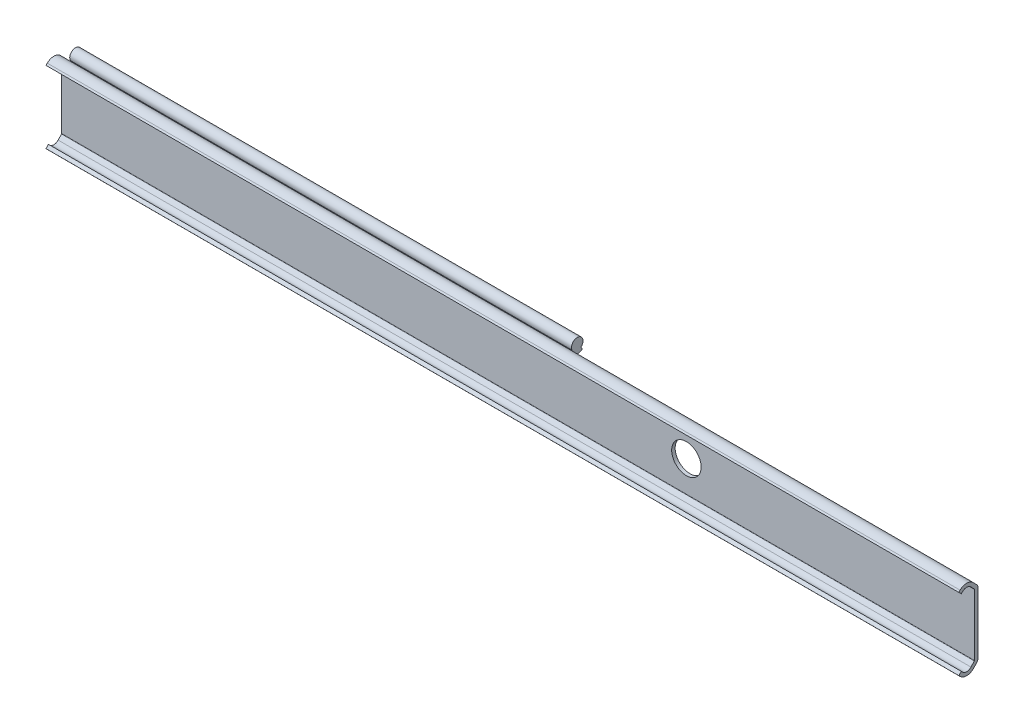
ISO-10303-21;
HEADER;
FILE_DESCRIPTION(('STEP AP214'),'2;1');
FILE_NAME('part.step','',(''),(''),'','','');
FILE_SCHEMA(('AUTOMOTIVE_DESIGN { 1 0 10303 214 1 1 1 1 }'));
ENDSEC;
DATA;
#1=APPLICATION_CONTEXT('core data for automotive mechanical design processes');
#2=APPLICATION_PROTOCOL_DEFINITION('international standard','automotive_design',2000,#1);
#3=PRODUCT_CONTEXT('',#1,'mechanical');
#4=PRODUCT('Part','Part','',(#3));
#5=PRODUCT_RELATED_PRODUCT_CATEGORY('part','',(#4));
#6=PRODUCT_DEFINITION_FORMATION('','',#4);
#7=PRODUCT_DEFINITION_CONTEXT('part definition',#1,'design');
#8=PRODUCT_DEFINITION('design','',#6,#7);
#9=PRODUCT_DEFINITION_SHAPE('','',#8);
#10=(LENGTH_UNIT() NAMED_UNIT(*) SI_UNIT(.MILLI.,.METRE.));
#11=(NAMED_UNIT(*) PLANE_ANGLE_UNIT() SI_UNIT($,.RADIAN.));
#12=(NAMED_UNIT(*) SI_UNIT($,.STERADIAN.) SOLID_ANGLE_UNIT());
#13=UNCERTAINTY_MEASURE_WITH_UNIT(LENGTH_MEASURE(1.E-05),#10,'distance_accuracy_value','');
#14=(GEOMETRIC_REPRESENTATION_CONTEXT(3) GLOBAL_UNCERTAINTY_ASSIGNED_CONTEXT((#13)) GLOBAL_UNIT_ASSIGNED_CONTEXT((#10,
#11,#12)) REPRESENTATION_CONTEXT('',''));
#15=CARTESIAN_POINT('',(0.,0.,0.));
#16=DIRECTION('',(0.,0.,1.));
#17=DIRECTION('',(1.,0.,0.));
#18=AXIS2_PLACEMENT_3D('',#15,#16,#17);
#19=CARTESIAN_POINT('',(-4.,-13.5610180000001,0.));
#20=DIRECTION('',(0.,0.,-1.));
#21=DIRECTION('',(1.,0.,0.));
#22=AXIS2_PLACEMENT_3D('',#19,#20,#21);
#23=PLANE('',#22);
#24=CARTESIAN_POINT('',(275.4,0.,0.));
#25=DIRECTION('',(0.,0.,1.));
#26=DIRECTION('',(0.,-1.,0.));
#27=AXIS2_PLACEMENT_3D('',#24,#25,#26);
#28=CIRCLE('',#27,6.5);
#29=CARTESIAN_POINT('',(275.4,-6.50000000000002,0.));
#30=VERTEX_POINT('',#29);
#31=EDGE_CURVE('E305',#30,#30,#28,.F.);
#32=ORIENTED_EDGE('',*,*,#31,.F.);
#33=EDGE_LOOP('',(#32));
#34=FACE_BOUND('',#33,.T.);
#35=DIRECTION('',(1.,0.,0.));
#36=VECTOR('',#35,1.);
#37=CARTESIAN_POINT('',(-4.,-13.5610180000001,0.));
#38=LINE('',#37,#36);
#39=CARTESIAN_POINT('',(0.,-13.5610180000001,0.));
#40=VERTEX_POINT('',#39);
#41=CARTESIAN_POINT('',(402.4,-13.561018,0.));
#42=VERTEX_POINT('',#41);
#43=EDGE_CURVE('E258',#40,#42,#38,.T.);
#44=ORIENTED_EDGE('',*,*,#43,.F.);
#45=DIRECTION('',(0.,-1.,0.));
#46=VECTOR('',#45,1.);
#47=CARTESIAN_POINT('',(0.,-10.7622239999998,0.));
#48=LINE('',#47,#46);
#49=CARTESIAN_POINT('',(0.,-10.7622239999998,0.));
#50=VERTEX_POINT('',#49);
#51=EDGE_CURVE('E478',#50,#40,#48,.T.);
#52=ORIENTED_EDGE('',*,*,#51,.F.);
#53=DIRECTION('',(1.,0.,0.));
#54=VECTOR('',#53,1.);
#55=CARTESIAN_POINT('',(0.,-10.7622239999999,0.));
#56=LINE('',#55,#54);
#57=CARTESIAN_POINT('',(221.2,-10.7622239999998,0.));
#58=VERTEX_POINT('',#57);
#59=EDGE_CURVE('E9',#50,#58,#56,.T.);
#60=ORIENTED_EDGE('',*,*,#59,.T.);
#61=DIRECTION('',(0.,1.,0.));
#62=VECTOR('',#61,1.);
#63=CARTESIAN_POINT('',(221.2,-30.,0.));
#64=LINE('',#63,#62);
#65=CARTESIAN_POINT('',(221.2,10.7622239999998,0.));
#66=VERTEX_POINT('',#65);
#67=EDGE_CURVE('E374',#58,#66,#64,.T.);
#68=ORIENTED_EDGE('',*,*,#67,.T.);
#69=DIRECTION('',(1.,0.,0.));
#70=VECTOR('',#69,1.);
#71=CARTESIAN_POINT('',(0.,10.7622239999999,0.));
#72=LINE('',#71,#70);
#73=CARTESIAN_POINT('',(0.,10.7622239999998,0.));
#74=VERTEX_POINT('',#73);
#75=EDGE_CURVE('E23',#74,#66,#72,.T.);
#76=ORIENTED_EDGE('',*,*,#75,.F.);
#77=DIRECTION('',(0.,-1.,0.));
#78=VECTOR('',#77,1.);
#79=CARTESIAN_POINT('',(0.,13.561018,0.));
#80=LINE('',#79,#78);
#81=CARTESIAN_POINT('',(0.,13.561018,0.));
#82=VERTEX_POINT('',#81);
#83=EDGE_CURVE('E238',#82,#74,#80,.T.);
#84=ORIENTED_EDGE('',*,*,#83,.F.);
#85=DIRECTION('',(1.,0.,0.));
#86=VECTOR('',#85,1.);
#87=CARTESIAN_POINT('',(-4.,13.561018,0.));
#88=LINE('',#87,#86);
#89=CARTESIAN_POINT('',(402.4,13.561018,0.));
#90=VERTEX_POINT('',#89);
#91=EDGE_CURVE('E249',#82,#90,#88,.T.);
#92=ORIENTED_EDGE('',*,*,#91,.T.);
#93=DIRECTION('',(0.,1.,0.));
#94=VECTOR('',#93,1.);
#95=CARTESIAN_POINT('',(402.4,-13.561018,0.));
#96=LINE('',#95,#94);
#97=EDGE_CURVE('E438',#42,#90,#96,.T.);
#98=ORIENTED_EDGE('',*,*,#97,.F.);
#99=EDGE_LOOP('',(#44,#52,#60,#68,#76,#84,#92,#98));
#100=FACE_BOUND('',#99,.T.);
#101=ADVANCED_FACE('F14',(#34,#100),#23,.T.);
#102=CARTESIAN_POINT('',(-4.,-13.5750000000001,5.));
#103=DIRECTION('',(1.,0.,0.));
#104=DIRECTION('',(0.,0.,1.));
#105=AXIS2_PLACEMENT_3D('',#102,#103,#104);
#106=CYLINDRICAL_SURFACE('',#105,4.1);
#107=DIRECTION('',(1.,0.,0.));
#108=VECTOR('',#107,1.);
#109=CARTESIAN_POINT('',(-4.,-16.4741282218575,7.89914738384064));
#110=LINE('',#109,#108);
#111=CARTESIAN_POINT('',(0.,-16.4741282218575,7.89914738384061));
#112=VERTEX_POINT('',#111);
#113=CARTESIAN_POINT('',(402.4,-16.4741282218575,7.89914738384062));
#114=VERTEX_POINT('',#113);
#115=EDGE_CURVE('E269',#112,#114,#110,.T.);
#116=ORIENTED_EDGE('',*,*,#115,.F.);
#117=CARTESIAN_POINT('',(0.,-13.5750000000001,5.));
#118=DIRECTION('',(-1.,0.,0.));
#119=DIRECTION('',(0.,0.,1.));
#120=AXIS2_PLACEMENT_3D('',#117,#118,#119);
#121=CIRCLE('',#120,4.09999999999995);
#122=CARTESIAN_POINT('',(0.,-16.4741282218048,2.10085261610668));
#123=VERTEX_POINT('',#122);
#124=EDGE_CURVE('E472',#123,#112,#121,.T.);
#125=ORIENTED_EDGE('',*,*,#124,.F.);
#126=DIRECTION('',(1.,0.,0.));
#127=VECTOR('',#126,1.);
#128=CARTESIAN_POINT('',(-4.,-16.4741282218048,2.10085261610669));
#129=LINE('',#128,#127);
#130=CARTESIAN_POINT('',(402.4,-16.4741282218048,2.10085261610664));
#131=VERTEX_POINT('',#130);
#132=EDGE_CURVE('E267',#123,#131,#129,.T.);
#133=ORIENTED_EDGE('',*,*,#132,.T.);
#134=CARTESIAN_POINT('',(402.4,-13.5750000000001,5.));
#135=DIRECTION('',(1.,0.,0.));
#136=DIRECTION('',(0.,0.,-1.));
#137=AXIS2_PLACEMENT_3D('',#134,#135,#136);
#138=CIRCLE('',#137,4.1);
#139=EDGE_CURVE('E392',#114,#131,#138,.T.);
#140=ORIENTED_EDGE('',*,*,#139,.F.);
#141=EDGE_LOOP('',(#116,#125,#133,#140));
#142=FACE_BOUND('',#141,.T.);
#143=ADVANCED_FACE('F573',(#142),#106,.T.);
#144=CARTESIAN_POINT('',(-4.,-15.8897090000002,8.46));
#145=DIRECTION('',(0.,-0.692409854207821,0.721504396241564));
#146=DIRECTION('',(0.,-0.721504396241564,-0.692409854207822));
#147=AXIS2_PLACEMENT_3D('',#144,#145,#146);
#148=PLANE('',#147);
#149=DIRECTION('',(1.,0.,0.));
#150=VECTOR('',#149,1.);
#151=CARTESIAN_POINT('',(-4.,-15.8897090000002,8.46));
#152=LINE('',#151,#150);
#153=CARTESIAN_POINT('',(0.,-15.8897090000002,8.46));
#154=VERTEX_POINT('',#153);
#155=CARTESIAN_POINT('',(402.4,-15.8897090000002,8.46));
#156=VERTEX_POINT('',#155);
#157=EDGE_CURVE('E271',#154,#156,#152,.T.);
#158=ORIENTED_EDGE('',*,*,#157,.F.);
#159=DIRECTION('',(0.,0.72150439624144,0.692409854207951));
#160=VECTOR('',#159,1.);
#161=CARTESIAN_POINT('',(0.,-16.4741282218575,7.89914738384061));
#162=LINE('',#161,#160);
#163=EDGE_CURVE('E470',#112,#154,#162,.T.);
#164=ORIENTED_EDGE('',*,*,#163,.F.);
#165=ORIENTED_EDGE('',*,*,#115,.T.);
#166=DIRECTION('',(0.,-0.721504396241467,-0.692409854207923));
#167=VECTOR('',#166,1.);
#168=CARTESIAN_POINT('',(402.4,-15.8897090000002,8.46));
#169=LINE('',#168,#167);
#170=EDGE_CURVE('E395',#156,#114,#169,.T.);
#171=ORIENTED_EDGE('',*,*,#170,.F.);
#172=EDGE_LOOP('',(#158,#164,#165,#171));
#173=FACE_BOUND('',#172,.T.);
#174=ADVANCED_FACE('F579',(#173),#148,.T.);
#175=CARTESIAN_POINT('',(-4.,-14.7934620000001,7.363752));
#176=DIRECTION('',(0.,0.707107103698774,0.707106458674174));
#177=DIRECTION('',(0.,-0.707106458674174,0.707107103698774));
#178=AXIS2_PLACEMENT_3D('',#175,#176,#177);
#179=PLANE('',#178);
#180=DIRECTION('',(1.,0.,0.));
#181=VECTOR('',#180,1.);
#182=CARTESIAN_POINT('',(-4.,-14.7934620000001,7.363752));
#183=LINE('',#182,#181);
#184=CARTESIAN_POINT('',(0.,-14.7934620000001,7.363752));
#185=VERTEX_POINT('',#184);
#186=CARTESIAN_POINT('',(402.4,-14.7934620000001,7.36375199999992));
#187=VERTEX_POINT('',#186);
#188=EDGE_CURVE('E273',#185,#187,#183,.T.);
#189=ORIENTED_EDGE('',*,*,#188,.F.);
#190=DIRECTION('',(0.,0.707106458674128,-0.70710710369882));
#191=VECTOR('',#190,1.);
#192=CARTESIAN_POINT('',(0.,-15.8897090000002,8.46));
#193=LINE('',#192,#191);
#194=EDGE_CURVE('E468',#154,#185,#193,.T.);
#195=ORIENTED_EDGE('',*,*,#194,.F.);
#196=ORIENTED_EDGE('',*,*,#157,.T.);
#197=DIRECTION('',(0.,-0.707106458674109,0.707107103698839));
#198=VECTOR('',#197,1.);
#199=CARTESIAN_POINT('',(402.4,-14.7934620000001,7.36375199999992));
#200=LINE('',#199,#198);
#201=EDGE_CURVE('E398',#187,#156,#200,.T.);
#202=ORIENTED_EDGE('',*,*,#201,.F.);
#203=EDGE_LOOP('',(#189,#195,#196,#202));
#204=FACE_BOUND('',#203,.T.);
#205=ADVANCED_FACE('F583',(#204),#179,.T.);
#206=CARTESIAN_POINT('',(-4.,-15.3880487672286,6.79314086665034));
#207=DIRECTION('',(0.,0.692410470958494,-0.721503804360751));
#208=DIRECTION('',(0.,0.721503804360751,0.692410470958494));
#209=AXIS2_PLACEMENT_3D('',#206,#207,#208);
#210=PLANE('',#209);
#211=DIRECTION('',(1.,0.,0.));
#212=VECTOR('',#211,1.);
#213=CARTESIAN_POINT('',(-4.,-15.3880487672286,6.79314086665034));
#214=LINE('',#213,#212);
#215=CARTESIAN_POINT('',(0.,-15.3880487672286,6.79314086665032));
#216=VERTEX_POINT('',#215);
#217=CARTESIAN_POINT('',(402.4,-15.3880487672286,6.79314086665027));
#218=VERTEX_POINT('',#217);
#219=EDGE_CURVE('E275',#216,#218,#214,.T.);
#220=ORIENTED_EDGE('',*,*,#219,.F.);
#221=DIRECTION('',(0.,-0.721503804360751,-0.692410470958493));
#222=VECTOR('',#221,1.);
#223=CARTESIAN_POINT('',(0.,-14.7934620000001,7.363752));
#224=LINE('',#223,#222);
#225=EDGE_CURVE('E466',#185,#216,#224,.T.);
#226=ORIENTED_EDGE('',*,*,#225,.F.);
#227=ORIENTED_EDGE('',*,*,#188,.T.);
#228=DIRECTION('',(0.,0.721503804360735,0.69241047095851));
#229=VECTOR('',#228,1.);
#230=CARTESIAN_POINT('',(402.4,-15.3880487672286,6.79314086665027));
#231=LINE('',#230,#229);
#232=EDGE_CURVE('E401',#218,#187,#231,.T.);
#233=ORIENTED_EDGE('',*,*,#232,.F.);
#234=EDGE_LOOP('',(#220,#226,#227,#233));
#235=FACE_BOUND('',#234,.T.);
#236=ADVANCED_FACE('F588',(#235),#210,.T.);
#237=CARTESIAN_POINT('',(-4.,-13.5750000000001,5.));
#238=DIRECTION('',(1.,0.,0.));
#239=DIRECTION('',(0.,0.,1.));
#240=AXIS2_PLACEMENT_3D('',#237,#238,#239);
#241=CYLINDRICAL_SURFACE('',#240,2.55);
#242=DIRECTION('',(1.,0.,0.));
#243=VECTOR('',#242,1.);
#244=CARTESIAN_POINT('',(-4.,-15.292068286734,3.11474762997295));
#245=LINE('',#244,#243);
#246=CARTESIAN_POINT('',(0.,-15.2920682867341,3.11474762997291));
#247=VERTEX_POINT('',#246);
#248=CARTESIAN_POINT('',(402.4,-15.292068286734,3.11474762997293));
#249=VERTEX_POINT('',#248);
#250=EDGE_CURVE('E277',#247,#249,#245,.T.);
#251=ORIENTED_EDGE('',*,*,#250,.F.);
#252=CARTESIAN_POINT('',(0.,-13.5750000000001,5.));
#253=DIRECTION('',(1.,0.,0.));
#254=DIRECTION('',(0.,0.,1.));
#255=AXIS2_PLACEMENT_3D('',#252,#253,#254);
#256=CIRCLE('',#255,2.55000000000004);
#257=EDGE_CURVE('E464',#216,#247,#256,.T.);
#258=ORIENTED_EDGE('',*,*,#257,.F.);
#259=ORIENTED_EDGE('',*,*,#219,.T.);
#260=CARTESIAN_POINT('',(402.4,-13.5750000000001,5.));
#261=DIRECTION('',(-1.,0.,0.));
#262=DIRECTION('',(0.,0.,-1.));
#263=AXIS2_PLACEMENT_3D('',#260,#261,#262);
#264=CIRCLE('',#263,2.55);
#265=EDGE_CURVE('E404',#249,#218,#264,.T.);
#266=ORIENTED_EDGE('',*,*,#265,.F.);
#267=EDGE_LOOP('',(#251,#258,#259,#266));
#268=FACE_BOUND('',#267,.T.);
#269=ADVANCED_FACE('F594',(#268),#241,.F.);
#270=CARTESIAN_POINT('',(-4.,-13.734120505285,1.61962394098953));
#271=DIRECTION('',(0.,0.692409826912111,0.721504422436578));
#272=DIRECTION('',(0.,-0.721504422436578,0.692409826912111));
#273=AXIS2_PLACEMENT_3D('',#270,#271,#272);
#274=PLANE('',#273);
#275=DIRECTION('',(1.,0.,0.));
#276=VECTOR('',#275,1.);
#277=CARTESIAN_POINT('',(-4.,-13.734120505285,1.61962394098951));
#278=LINE('',#277,#276);
#279=CARTESIAN_POINT('',(0.,-13.734120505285,1.61962394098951));
#280=VERTEX_POINT('',#279);
#281=CARTESIAN_POINT('',(402.4,-13.734120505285,1.6196239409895));
#282=VERTEX_POINT('',#281);
#283=EDGE_CURVE('E279',#280,#282,#278,.T.);
#284=ORIENTED_EDGE('',*,*,#283,.F.);
#285=DIRECTION('',(0.,0.721504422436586,-0.692409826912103));
#286=VECTOR('',#285,1.);
#287=CARTESIAN_POINT('',(0.,-15.2920682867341,3.11474762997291));
#288=LINE('',#287,#286);
#289=EDGE_CURVE('E462',#247,#280,#288,.T.);
#290=ORIENTED_EDGE('',*,*,#289,.F.);
#291=ORIENTED_EDGE('',*,*,#250,.T.);
#292=DIRECTION('',(0.,-0.721504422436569,0.692409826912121));
#293=VECTOR('',#292,1.);
#294=CARTESIAN_POINT('',(402.4,-13.734120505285,1.6196239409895));
#295=LINE('',#294,#293);
#296=EDGE_CURVE('E407',#282,#249,#295,.T.);
#297=ORIENTED_EDGE('',*,*,#296,.F.);
#298=EDGE_LOOP('',(#284,#290,#291,#297));
#299=FACE_BOUND('',#298,.T.);
#300=ADVANCED_FACE('F598',(#299),#274,.T.);
#301=CARTESIAN_POINT('',(-4.,-13.561018,1.8));
#302=DIRECTION('',(1.,0.,0.));
#303=DIRECTION('',(0.,0.,1.));
#304=AXIS2_PLACEMENT_3D('',#301,#302,#303);
#305=CYLINDRICAL_SURFACE('',#304,0.250000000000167);
#306=DIRECTION('',(1.,0.,0.));
#307=VECTOR('',#306,1.);
#308=CARTESIAN_POINT('',(-4.,-13.5610180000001,1.54999999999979));
#309=LINE('',#308,#307);
#310=CARTESIAN_POINT('',(0.,-13.5610180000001,1.5499999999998));
#311=VERTEX_POINT('',#310);
#312=CARTESIAN_POINT('',(402.4,-13.561018,1.54999999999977));
#313=VERTEX_POINT('',#312);
#314=EDGE_CURVE('E281',#311,#313,#309,.T.);
#315=ORIENTED_EDGE('',*,*,#314,.F.);
#316=CARTESIAN_POINT('',(0.,-13.561018,1.8));
#317=DIRECTION('',(1.,0.,0.));
#318=DIRECTION('',(0.,0.,1.));
#319=AXIS2_PLACEMENT_3D('',#316,#317,#318);
#320=CIRCLE('',#319,0.250000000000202);
#321=EDGE_CURVE('E460',#280,#311,#320,.T.);
#322=ORIENTED_EDGE('',*,*,#321,.F.);
#323=ORIENTED_EDGE('',*,*,#283,.T.);
#324=CARTESIAN_POINT('',(402.4,-13.561018,1.79999999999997));
#325=DIRECTION('',(-1.,0.,0.));
#326=DIRECTION('',(0.,0.,-1.));
#327=AXIS2_PLACEMENT_3D('',#324,#325,#326);
#328=CIRCLE('',#327,0.250000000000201);
#329=EDGE_CURVE('E410',#313,#282,#328,.T.);
#330=ORIENTED_EDGE('',*,*,#329,.F.);
#331=EDGE_LOOP('',(#315,#322,#323,#330));
#332=FACE_BOUND('',#331,.T.);
#333=ADVANCED_FACE('F603',(#332),#305,.F.);
#334=CARTESIAN_POINT('',(-4.,13.561018,1.54999999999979));
#335=DIRECTION('',(0.,0.,1.));
#336=DIRECTION('',(-1.,0.,0.));
#337=AXIS2_PLACEMENT_3D('',#334,#335,#336);
#338=PLANE('',#337);
#339=CARTESIAN_POINT('',(275.4,0.,1.54999999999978));
#340=DIRECTION('',(0.,0.,1.));
#341=DIRECTION('',(-1.,0.,0.));
#342=AXIS2_PLACEMENT_3D('',#339,#340,#341);
#343=CIRCLE('',#342,6.5);
#344=CARTESIAN_POINT('',(268.9,0.,1.54999999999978));
#345=VERTEX_POINT('',#344);
#346=EDGE_CURVE('E298',#345,#345,#343,.F.);
#347=ORIENTED_EDGE('',*,*,#346,.T.);
#348=EDGE_LOOP('',(#347));
#349=FACE_BOUND('',#348,.T.);
#350=DIRECTION('',(1.,0.,0.));
#351=VECTOR('',#350,1.);
#352=CARTESIAN_POINT('',(-4.,13.561018,1.54999999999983));
#353=LINE('',#352,#351);
#354=CARTESIAN_POINT('',(0.,13.561018,1.54999999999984));
#355=VERTEX_POINT('',#354);
#356=CARTESIAN_POINT('',(402.4,13.561018,1.54999999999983));
#357=VERTEX_POINT('',#356);
#358=EDGE_CURVE('E283',#355,#357,#353,.T.);
#359=ORIENTED_EDGE('',*,*,#358,.F.);
#360=DIRECTION('',(0.,1.,0.));
#361=VECTOR('',#360,1.);
#362=CARTESIAN_POINT('',(0.,-13.5610180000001,1.5499999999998));
#363=LINE('',#362,#361);
#364=EDGE_CURVE('E458',#311,#355,#363,.T.);
#365=ORIENTED_EDGE('',*,*,#364,.F.);
#366=ORIENTED_EDGE('',*,*,#314,.T.);
#367=DIRECTION('',(0.,-1.,0.));
#368=VECTOR('',#367,1.);
#369=CARTESIAN_POINT('',(402.4,13.561018,1.54999999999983));
#370=LINE('',#369,#368);
#371=EDGE_CURVE('E413',#357,#313,#370,.T.);
#372=ORIENTED_EDGE('',*,*,#371,.F.);
#373=EDGE_LOOP('',(#359,#365,#366,#372));
#374=FACE_BOUND('',#373,.T.);
#375=ADVANCED_FACE('F609',(#349,#374),#338,.T.);
#376=CARTESIAN_POINT('',(-4.,13.5610179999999,1.8));
#377=DIRECTION('',(1.,0.,0.));
#378=DIRECTION('',(0.,0.,1.));
#379=AXIS2_PLACEMENT_3D('',#376,#377,#378);
#380=CYLINDRICAL_SURFACE('',#379,0.250000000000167);
#381=DIRECTION('',(1.,0.,0.));
#382=VECTOR('',#381,1.);
#383=CARTESIAN_POINT('',(-4.,13.7341205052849,1.61962394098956));
#384=LINE('',#383,#382);
#385=CARTESIAN_POINT('',(0.,13.7341205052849,1.61962394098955));
#386=VERTEX_POINT('',#385);
#387=CARTESIAN_POINT('',(402.4,13.7341205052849,1.61962394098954));
#388=VERTEX_POINT('',#387);
#389=EDGE_CURVE('E285',#386,#388,#384,.T.);
#390=ORIENTED_EDGE('',*,*,#389,.F.);
#391=CARTESIAN_POINT('',(0.,13.5610179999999,1.8));
#392=DIRECTION('',(1.,0.,0.));
#393=DIRECTION('',(0.,0.,1.));
#394=AXIS2_PLACEMENT_3D('',#391,#392,#393);
#395=CIRCLE('',#394,0.250000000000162);
#396=EDGE_CURVE('E456',#355,#386,#395,.T.);
#397=ORIENTED_EDGE('',*,*,#396,.F.);
#398=ORIENTED_EDGE('',*,*,#358,.T.);
#399=CARTESIAN_POINT('',(402.4,13.561018,1.79999999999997));
#400=DIRECTION('',(-1.,0.,0.));
#401=DIRECTION('',(0.,0.,-1.));
#402=AXIS2_PLACEMENT_3D('',#399,#400,#401);
#403=CIRCLE('',#402,0.250000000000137);
#404=EDGE_CURVE('E416',#388,#357,#403,.T.);
#405=ORIENTED_EDGE('',*,*,#404,.F.);
#406=EDGE_LOOP('',(#390,#397,#398,#405));
#407=FACE_BOUND('',#406,.T.);
#408=ADVANCED_FACE('F613',(#407),#380,.F.);
#409=CARTESIAN_POINT('',(-4.,13.7341205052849,1.61962394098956));
#410=DIRECTION('',(0.,-0.692409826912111,0.721504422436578));
#411=DIRECTION('',(0.,-0.721504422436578,-0.692409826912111));
#412=AXIS2_PLACEMENT_3D('',#409,#410,#411);
#413=PLANE('',#412);
#414=DIRECTION('',(1.,0.,0.));
#415=VECTOR('',#414,1.);
#416=CARTESIAN_POINT('',(-4.,15.2920682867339,3.11474762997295));
#417=LINE('',#416,#415);
#418=CARTESIAN_POINT('',(0.,15.2920682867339,3.11474762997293));
#419=VERTEX_POINT('',#418);
#420=CARTESIAN_POINT('',(402.4,15.2920682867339,3.11474762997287));
#421=VERTEX_POINT('',#420);
#422=EDGE_CURVE('E287',#419,#421,#417,.T.);
#423=ORIENTED_EDGE('',*,*,#422,.F.);
#424=DIRECTION('',(0.,0.721504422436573,0.692409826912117));
#425=VECTOR('',#424,1.);
#426=CARTESIAN_POINT('',(0.,13.7341205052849,1.61962394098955));
#427=LINE('',#426,#425);
#428=EDGE_CURVE('E454',#386,#419,#427,.T.);
#429=ORIENTED_EDGE('',*,*,#428,.F.);
#430=ORIENTED_EDGE('',*,*,#389,.T.);
#431=DIRECTION('',(0.,-0.7215044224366,-0.692409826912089));
#432=VECTOR('',#431,1.);
#433=CARTESIAN_POINT('',(402.4,15.2920682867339,3.11474762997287));
#434=LINE('',#433,#432);
#435=EDGE_CURVE('E419',#421,#388,#434,.T.);
#436=ORIENTED_EDGE('',*,*,#435,.F.);
#437=EDGE_LOOP('',(#423,#429,#430,#436));
#438=FACE_BOUND('',#437,.T.);
#439=ADVANCED_FACE('F618',(#438),#413,.T.);
#440=CARTESIAN_POINT('',(-4.,13.575,5.));
#441=DIRECTION('',(1.,0.,0.));
#442=DIRECTION('',(0.,0.,1.));
#443=AXIS2_PLACEMENT_3D('',#440,#441,#442);
#444=CYLINDRICAL_SURFACE('',#443,2.55);
#445=DIRECTION('',(1.,0.,0.));
#446=VECTOR('',#445,1.);
#447=CARTESIAN_POINT('',(-4.,15.3880487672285,6.79314086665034));
#448=LINE('',#447,#446);
#449=CARTESIAN_POINT('',(0.,15.3880487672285,6.7931408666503));
#450=VERTEX_POINT('',#449);
#451=CARTESIAN_POINT('',(402.4,15.3880487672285,6.79314086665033));
#452=VERTEX_POINT('',#451);
#453=EDGE_CURVE('E289',#450,#452,#448,.T.);
#454=ORIENTED_EDGE('',*,*,#453,.F.);
#455=CARTESIAN_POINT('',(0.,13.575,5.));
#456=DIRECTION('',(1.,0.,0.));
#457=DIRECTION('',(0.,0.,1.));
#458=AXIS2_PLACEMENT_3D('',#455,#456,#457);
#459=CIRCLE('',#458,2.55);
#460=EDGE_CURVE('E452',#419,#450,#459,.T.);
#461=ORIENTED_EDGE('',*,*,#460,.F.);
#462=ORIENTED_EDGE('',*,*,#422,.T.);
#463=CARTESIAN_POINT('',(402.4,13.575,5.));
#464=DIRECTION('',(-1.,0.,0.));
#465=DIRECTION('',(0.,0.,-1.));
#466=AXIS2_PLACEMENT_3D('',#463,#464,#465);
#467=CIRCLE('',#466,2.55000000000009);
#468=EDGE_CURVE('E422',#452,#421,#467,.T.);
#469=ORIENTED_EDGE('',*,*,#468,.F.);
#470=EDGE_LOOP('',(#454,#461,#462,#469));
#471=FACE_BOUND('',#470,.T.);
#472=ADVANCED_FACE('F624',(#471),#444,.F.);
#473=CARTESIAN_POINT('',(-4.,15.3880487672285,6.79314086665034));
#474=DIRECTION('',(0.,-0.692410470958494,-0.721503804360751));
#475=DIRECTION('',(0.,0.721503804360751,-0.692410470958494));
#476=AXIS2_PLACEMENT_3D('',#473,#474,#475);
#477=PLANE('',#476);
#478=DIRECTION('',(1.,0.,0.));
#479=VECTOR('',#478,1.);
#480=CARTESIAN_POINT('',(-4.,14.7934620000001,7.363752));
#481=LINE('',#480,#479);
#482=CARTESIAN_POINT('',(0.,14.7934620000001,7.363752));
#483=VERTEX_POINT('',#482);
#484=CARTESIAN_POINT('',(402.4,14.7934620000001,7.363752));
#485=VERTEX_POINT('',#484);
#486=EDGE_CURVE('E291',#483,#485,#481,.T.);
#487=ORIENTED_EDGE('',*,*,#486,.F.);
#488=DIRECTION('',(0.,-0.72150380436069,0.692410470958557));
#489=VECTOR('',#488,1.);
#490=CARTESIAN_POINT('',(0.,15.3880487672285,6.7931408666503));
#491=LINE('',#490,#489);
#492=EDGE_CURVE('E450',#450,#483,#491,.T.);
#493=ORIENTED_EDGE('',*,*,#492,.F.);
#494=ORIENTED_EDGE('',*,*,#453,.T.);
#495=DIRECTION('',(0.,0.721503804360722,-0.692410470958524));
#496=VECTOR('',#495,1.);
#497=CARTESIAN_POINT('',(402.4,14.7934620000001,7.363752));
#498=LINE('',#497,#496);
#499=EDGE_CURVE('E425',#485,#452,#498,.T.);
#500=ORIENTED_EDGE('',*,*,#499,.F.);
#501=EDGE_LOOP('',(#487,#493,#494,#500));
#502=FACE_BOUND('',#501,.T.);
#503=ADVANCED_FACE('F628',(#502),#477,.T.);
#504=CARTESIAN_POINT('',(-4.,14.7934620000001,7.363752));
#505=DIRECTION('',(0.,-0.707107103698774,0.707106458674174));
#506=DIRECTION('',(0.,-0.707106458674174,-0.707107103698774));
#507=AXIS2_PLACEMENT_3D('',#504,#505,#506);
#508=PLANE('',#507);
#509=DIRECTION('',(1.,0.,0.));
#510=VECTOR('',#509,1.);
#511=CARTESIAN_POINT('',(-4.,15.8897090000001,8.46));
#512=LINE('',#511,#510);
#513=CARTESIAN_POINT('',(0.,15.8897090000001,8.46));
#514=VERTEX_POINT('',#513);
#515=CARTESIAN_POINT('',(402.4,15.8897090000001,8.46));
#516=VERTEX_POINT('',#515);
#517=EDGE_CURVE('E292',#514,#516,#512,.T.);
#518=ORIENTED_EDGE('',*,*,#517,.F.);
#519=DIRECTION('',(0.,0.707106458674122,0.707107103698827));
#520=VECTOR('',#519,1.);
#521=CARTESIAN_POINT('',(0.,14.7934620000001,7.363752));
#522=LINE('',#521,#520);
#523=EDGE_CURVE('E448',#483,#514,#522,.T.);
#524=ORIENTED_EDGE('',*,*,#523,.F.);
#525=ORIENTED_EDGE('',*,*,#486,.T.);
#526=DIRECTION('',(0.,-0.707106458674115,-0.707107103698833));
#527=VECTOR('',#526,1.);
#528=CARTESIAN_POINT('',(402.4,15.8897090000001,8.46));
#529=LINE('',#528,#527);
#530=EDGE_CURVE('E428',#516,#485,#529,.T.);
#531=ORIENTED_EDGE('',*,*,#530,.F.);
#532=EDGE_LOOP('',(#518,#524,#525,#531));
#533=FACE_BOUND('',#532,.T.);
#534=ADVANCED_FACE('F631',(#533),#508,.T.);
#535=CARTESIAN_POINT('',(-4.,15.8897090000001,8.46));
#536=DIRECTION('',(0.,0.692409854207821,0.721504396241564));
#537=DIRECTION('',(0.,-0.721504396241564,0.692409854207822));
#538=AXIS2_PLACEMENT_3D('',#535,#536,#537);
#539=PLANE('',#538);
#540=DIRECTION('',(1.,0.,0.));
#541=VECTOR('',#540,1.);
#542=CARTESIAN_POINT('',(-4.,16.4741282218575,7.89914738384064));
#543=LINE('',#542,#541);
#544=CARTESIAN_POINT('',(0.,16.4741282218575,7.89914738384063));
#545=VERTEX_POINT('',#544);
#546=CARTESIAN_POINT('',(402.4,16.4741282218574,7.89914738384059));
#547=VERTEX_POINT('',#546);
#548=EDGE_CURVE('E18',#545,#547,#543,.T.);
#549=ORIENTED_EDGE('',*,*,#548,.F.);
#550=DIRECTION('',(0.,0.721504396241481,-0.692409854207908));
#551=VECTOR('',#550,1.);
#552=CARTESIAN_POINT('',(0.,15.8897090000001,8.46));
#553=LINE('',#552,#551);
#554=EDGE_CURVE('E446',#514,#545,#553,.T.);
#555=ORIENTED_EDGE('',*,*,#554,.F.);
#556=ORIENTED_EDGE('',*,*,#517,.T.);
#557=DIRECTION('',(0.,-0.721504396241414,0.692409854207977));
#558=VECTOR('',#557,1.);
#559=CARTESIAN_POINT('',(402.4,16.4741282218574,7.89914738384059));
#560=LINE('',#559,#558);
#561=EDGE_CURVE('E431',#547,#516,#560,.T.);
#562=ORIENTED_EDGE('',*,*,#561,.F.);
#563=EDGE_LOOP('',(#549,#555,#556,#562));
#564=FACE_BOUND('',#563,.T.);
#565=ADVANCED_FACE('F633',(#564),#539,.T.);
#566=CARTESIAN_POINT('',(-4.,13.575,5.));
#567=DIRECTION('',(1.,0.,0.));
#568=DIRECTION('',(0.,0.,1.));
#569=AXIS2_PLACEMENT_3D('',#566,#567,#568);
#570=CYLINDRICAL_SURFACE('',#569,4.1);
#571=DIRECTION('',(1.,0.,0.));
#572=VECTOR('',#571,1.);
#573=CARTESIAN_POINT('',(-4.,16.4741282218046,2.10085261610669));
#574=LINE('',#573,#572);
#575=CARTESIAN_POINT('',(0.,16.4741282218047,2.10085261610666));
#576=VERTEX_POINT('',#575);
#577=CARTESIAN_POINT('',(402.4,16.4741282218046,2.10085261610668));
#578=VERTEX_POINT('',#577);
#579=EDGE_CURVE('E260',#576,#578,#574,.T.);
#580=ORIENTED_EDGE('',*,*,#579,.F.);
#581=CARTESIAN_POINT('',(0.,13.575,5.));
#582=DIRECTION('',(-1.,0.,0.));
#583=DIRECTION('',(0.,0.,1.));
#584=AXIS2_PLACEMENT_3D('',#581,#582,#583);
#585=CIRCLE('',#584,4.1);
#586=EDGE_CURVE('E444',#545,#576,#585,.T.);
#587=ORIENTED_EDGE('',*,*,#586,.F.);
#588=ORIENTED_EDGE('',*,*,#548,.T.);
#589=CARTESIAN_POINT('',(402.4,13.575,5.));
#590=DIRECTION('',(1.,0.,0.));
#591=DIRECTION('',(0.,0.,-1.));
#592=AXIS2_PLACEMENT_3D('',#589,#590,#591);
#593=CIRCLE('',#592,4.1);
#594=EDGE_CURVE('E433',#578,#547,#593,.T.);
#595=ORIENTED_EDGE('',*,*,#594,.F.);
#596=EDGE_LOOP('',(#580,#587,#588,#595));
#597=FACE_BOUND('',#596,.T.);
#598=ADVANCED_FACE('F16',(#597),#570,.T.);
#599=CARTESIAN_POINT('',(-4.,14.8073560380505,0.501292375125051));
#600=DIRECTION('',(0.,0.692409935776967,-0.721504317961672));
#601=DIRECTION('',(0.,0.721504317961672,0.692409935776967));
#602=AXIS2_PLACEMENT_3D('',#599,#600,#601);
#603=PLANE('',#602);
#604=DIRECTION('',(1.,0.,0.));
#605=VECTOR('',#604,1.);
#606=CARTESIAN_POINT('',(-4.,14.8073560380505,0.501292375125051));
#607=LINE('',#606,#605);
#608=CARTESIAN_POINT('',(0.,14.8073560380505,0.501292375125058));
#609=VERTEX_POINT('',#608);
#610=CARTESIAN_POINT('',(402.4,14.8073560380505,0.501292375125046));
#611=VERTEX_POINT('',#610);
#612=EDGE_CURVE('E257',#609,#611,#607,.T.);
#613=ORIENTED_EDGE('',*,*,#612,.F.);
#614=DIRECTION('',(0.,-0.721504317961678,-0.692409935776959));
#615=VECTOR('',#614,1.);
#616=CARTESIAN_POINT('',(0.,16.4741282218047,2.10085261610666));
#617=LINE('',#616,#615);
#618=EDGE_CURVE('E240',#576,#609,#617,.T.);
#619=ORIENTED_EDGE('',*,*,#618,.F.);
#620=ORIENTED_EDGE('',*,*,#579,.T.);
#621=DIRECTION('',(0.,0.721504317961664,0.692409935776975));
#622=VECTOR('',#621,1.);
#623=CARTESIAN_POINT('',(402.4,14.8073560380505,0.501292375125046));
#624=LINE('',#623,#622);
#625=EDGE_CURVE('E435',#611,#578,#624,.T.);
#626=ORIENTED_EDGE('',*,*,#625,.F.);
#627=EDGE_LOOP('',(#613,#619,#620,#626));
#628=FACE_BOUND('',#627,.T.);
#629=ADVANCED_FACE('F641',(#628),#603,.T.);
#630=CARTESIAN_POINT('',(-4.,-14.8073560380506,0.501292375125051));
#631=DIRECTION('',(0.,-0.692409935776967,-0.721504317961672));
#632=DIRECTION('',(0.,0.721504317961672,-0.692409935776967));
#633=AXIS2_PLACEMENT_3D('',#630,#631,#632);
#634=PLANE('',#633);
#635=ORIENTED_EDGE('',*,*,#132,.F.);
#636=DIRECTION('',(0.,-0.721504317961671,0.692409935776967));
#637=VECTOR('',#636,1.);
#638=CARTESIAN_POINT('',(0.,-14.8073560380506,0.501292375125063));
#639=LINE('',#638,#637);
#640=CARTESIAN_POINT('',(0.,-14.8073560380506,0.501292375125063));
#641=VERTEX_POINT('',#640);
#642=EDGE_CURVE('E474',#641,#123,#639,.T.);
#643=ORIENTED_EDGE('',*,*,#642,.F.);
#644=DIRECTION('',(1.,0.,0.));
#645=VECTOR('',#644,1.);
#646=CARTESIAN_POINT('',(-4.,-14.8073560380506,0.501292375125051));
#647=LINE('',#646,#645);
#648=CARTESIAN_POINT('',(402.4,-14.8073560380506,0.501292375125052));
#649=VERTEX_POINT('',#648);
#650=EDGE_CURVE('E262',#641,#649,#647,.T.);
#651=ORIENTED_EDGE('',*,*,#650,.T.);
#652=DIRECTION('',(0.,0.721504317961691,-0.692409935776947));
#653=VECTOR('',#652,1.);
#654=CARTESIAN_POINT('',(402.4,-16.4741282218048,2.10085261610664));
#655=LINE('',#654,#653);
#656=EDGE_CURVE('E387',#131,#649,#655,.T.);
#657=ORIENTED_EDGE('',*,*,#656,.F.);
#658=EDGE_LOOP('',(#635,#643,#651,#657));
#659=FACE_BOUND('',#658,.T.);
#660=ADVANCED_FACE('F566',(#659),#634,.T.);
#661=CARTESIAN_POINT('',(-4.,13.5610179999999,1.8));
#662=DIRECTION('',(1.,0.,0.));
#663=DIRECTION('',(0.,0.,1.));
#664=AXIS2_PLACEMENT_3D('',#661,#662,#663);
#665=CYLINDRICAL_SURFACE('',#664,1.8);
#666=ORIENTED_EDGE('',*,*,#91,.F.);
#667=CARTESIAN_POINT('',(0.,13.5610179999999,1.8));
#668=DIRECTION('',(-1.,0.,0.));
#669=DIRECTION('',(0.,0.,1.));
#670=AXIS2_PLACEMENT_3D('',#667,#668,#669);
#671=CIRCLE('',#670,1.8);
#672=EDGE_CURVE('E235',#609,#82,#671,.T.);
#673=ORIENTED_EDGE('',*,*,#672,.F.);
#674=ORIENTED_EDGE('',*,*,#612,.T.);
#675=CARTESIAN_POINT('',(402.4,13.561018,1.79999999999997));
#676=DIRECTION('',(1.,0.,0.));
#677=DIRECTION('',(0.,0.,-1.));
#678=AXIS2_PLACEMENT_3D('',#675,#676,#677);
#679=CIRCLE('',#678,1.8);
#680=EDGE_CURVE('E256',#90,#611,#679,.T.);
#681=ORIENTED_EDGE('',*,*,#680,.F.);
#682=EDGE_LOOP('',(#666,#673,#674,#681));
#683=FACE_BOUND('',#682,.T.);
#684=ADVANCED_FACE('F254',(#683),#665,.T.);
#685=CARTESIAN_POINT('',(-4.,-13.561018,1.8));
#686=DIRECTION('',(1.,0.,0.));
#687=DIRECTION('',(0.,0.,1.));
#688=AXIS2_PLACEMENT_3D('',#685,#686,#687);
#689=CYLINDRICAL_SURFACE('',#688,1.8);
#690=ORIENTED_EDGE('',*,*,#650,.F.);
#691=CARTESIAN_POINT('',(0.,-13.561018,1.8));
#692=DIRECTION('',(-1.,0.,0.));
#693=DIRECTION('',(0.,0.,1.));
#694=AXIS2_PLACEMENT_3D('',#691,#692,#693);
#695=CIRCLE('',#694,1.8);
#696=EDGE_CURVE('E476',#40,#641,#695,.T.);
#697=ORIENTED_EDGE('',*,*,#696,.F.);
#698=ORIENTED_EDGE('',*,*,#43,.T.);
#699=CARTESIAN_POINT('',(402.4,-13.561018,1.79999999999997));
#700=DIRECTION('',(1.,0.,0.));
#701=DIRECTION('',(0.,0.,-1.));
#702=AXIS2_PLACEMENT_3D('',#699,#700,#701);
#703=CIRCLE('',#702,1.80000000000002);
#704=EDGE_CURVE('E440',#649,#42,#703,.T.);
#705=ORIENTED_EDGE('',*,*,#704,.F.);
#706=EDGE_LOOP('',(#690,#697,#698,#705));
#707=FACE_BOUND('',#706,.T.);
#708=ADVANCED_FACE('F561',(#707),#689,.T.);
#709=CARTESIAN_POINT('',(0.,-10.7622239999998,-1.66));
#710=DIRECTION('',(1.,0.,0.));
#711=DIRECTION('',(0.,0.,1.));
#712=AXIS2_PLACEMENT_3D('',#709,#710,#711);
#713=CYLINDRICAL_SURFACE('',#712,1.66);
#714=ORIENTED_EDGE('',*,*,#59,.F.);
#715=CARTESIAN_POINT('',(0.,-10.7622239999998,-1.66));
#716=DIRECTION('',(-1.,0.,0.));
#717=DIRECTION('',(0.,0.,1.));
#718=AXIS2_PLACEMENT_3D('',#715,#716,#717);
#719=CIRCLE('',#718,1.65999999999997);
#720=CARTESIAN_POINT('',(0.,-12.2669175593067,-2.36106867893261));
#721=VERTEX_POINT('',#720);
#722=EDGE_CURVE('E480',#721,#50,#719,.T.);
#723=ORIENTED_EDGE('',*,*,#722,.F.);
#724=DIRECTION('',(1.,0.,0.));
#725=VECTOR('',#724,1.);
#726=CARTESIAN_POINT('',(-37.0223030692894,-12.2669175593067,-2.36106867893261));
#727=LINE('',#726,#725);
#728=CARTESIAN_POINT('',(221.2,-12.2669175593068,-2.36106867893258));
#729=VERTEX_POINT('',#728);
#730=EDGE_CURVE('E376',#721,#729,#727,.T.);
#731=ORIENTED_EDGE('',*,*,#730,.T.);
#732=CARTESIAN_POINT('',(221.2,-10.7622239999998,-1.66));
#733=DIRECTION('',(-1.,0.,0.));
#734=DIRECTION('',(0.,0.,1.));
#735=AXIS2_PLACEMENT_3D('',#732,#733,#734);
#736=CIRCLE('',#735,1.66);
#737=EDGE_CURVE('E310',#58,#729,#736,.F.);
#738=ORIENTED_EDGE('',*,*,#737,.F.);
#739=EDGE_LOOP('',(#714,#723,#731,#738));
#740=FACE_BOUND('',#739,.T.);
#741=ADVANCED_FACE('F555',(#740),#713,.T.);
#742=CARTESIAN_POINT('',(0.,10.7622239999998,-1.66));
#743=DIRECTION('',(1.,0.,0.));
#744=DIRECTION('',(0.,0.,1.));
#745=AXIS2_PLACEMENT_3D('',#742,#743,#744);
#746=CYLINDRICAL_SURFACE('',#745,1.66);
#747=DIRECTION('',(1.,0.,0.));
#748=VECTOR('',#747,1.);
#749=CARTESIAN_POINT('',(-37.0223030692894,12.2669175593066,-2.36106867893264));
#750=LINE('',#749,#748);
#751=CARTESIAN_POINT('',(0.,12.2669175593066,-2.36106867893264));
#752=VERTEX_POINT('',#751);
#753=CARTESIAN_POINT('',(221.2,12.2669175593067,-2.36106867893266));
#754=VERTEX_POINT('',#753);
#755=EDGE_CURVE('E38',#752,#754,#750,.T.);
#756=ORIENTED_EDGE('',*,*,#755,.F.);
#757=CARTESIAN_POINT('',(0.,10.7622239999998,-1.66));
#758=DIRECTION('',(-1.,0.,0.));
#759=DIRECTION('',(0.,0.,1.));
#760=AXIS2_PLACEMENT_3D('',#757,#758,#759);
#761=CIRCLE('',#760,1.66);
#762=EDGE_CURVE('E31',#74,#752,#761,.T.);
#763=ORIENTED_EDGE('',*,*,#762,.F.);
#764=ORIENTED_EDGE('',*,*,#75,.T.);
#765=CARTESIAN_POINT('',(221.2,10.7622239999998,-1.66));
#766=DIRECTION('',(-1.,0.,0.));
#767=DIRECTION('',(0.,0.,1.));
#768=AXIS2_PLACEMENT_3D('',#765,#766,#767);
#769=CIRCLE('',#768,1.66);
#770=EDGE_CURVE('E346',#754,#66,#769,.F.);
#771=ORIENTED_EDGE('',*,*,#770,.F.);
#772=EDGE_LOOP('',(#756,#763,#764,#771));
#773=FACE_BOUND('',#772,.T.);
#774=ADVANCED_FACE('F802',(#773),#746,.T.);
#775=CARTESIAN_POINT('',(0.,11.8784795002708,-5.98462837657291));
#776=DIRECTION('',(0.,0.60181512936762,-0.798635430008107));
#777=DIRECTION('',(0.,0.798635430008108,0.60181512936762));
#778=AXIS2_PLACEMENT_3D('',#775,#776,#777);
#779=PLANE('',#778);
#780=DIRECTION('',(1.,0.,0.));
#781=VECTOR('',#780,1.);
#782=CARTESIAN_POINT('',(0.,11.0618539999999,-6.6));
#783=LINE('',#782,#781);
#784=CARTESIAN_POINT('',(0.,11.0618539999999,-6.6));
#785=VERTEX_POINT('',#784);
#786=CARTESIAN_POINT('',(221.2,11.0618539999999,-6.6));
#787=VERTEX_POINT('',#786);
#788=EDGE_CURVE('E341',#785,#787,#783,.T.);
#789=ORIENTED_EDGE('',*,*,#788,.F.);
#790=DIRECTION('',(0.,-0.798635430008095,-0.601815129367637));
#791=VECTOR('',#790,1.);
#792=CARTESIAN_POINT('',(0.,11.6159967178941,-6.18242339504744));
#793=LINE('',#792,#791);
#794=CARTESIAN_POINT('',(0.,11.6159967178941,-6.18242339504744));
#795=VERTEX_POINT('',#794);
#796=EDGE_CURVE('E500',#795,#785,#793,.T.);
#797=ORIENTED_EDGE('',*,*,#796,.F.);
#798=DIRECTION('',(1.,0.,0.));
#799=VECTOR('',#798,1.);
#800=CARTESIAN_POINT('',(-37.0223030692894,11.6159967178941,-6.18242339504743));
#801=LINE('',#800,#799);
#802=CARTESIAN_POINT('',(221.2,11.6159967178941,-6.18242339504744));
#803=VERTEX_POINT('',#802);
#804=EDGE_CURVE('E381',#795,#803,#801,.T.);
#805=ORIENTED_EDGE('',*,*,#804,.T.);
#806=DIRECTION('',(0.,0.798635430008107,0.60181512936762));
#807=VECTOR('',#806,1.);
#808=CARTESIAN_POINT('',(221.2,11.8784795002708,-5.98462837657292));
#809=LINE('',#808,#807);
#810=EDGE_CURVE('E349',#787,#803,#809,.T.);
#811=ORIENTED_EDGE('',*,*,#810,.F.);
#812=EDGE_LOOP('',(#789,#797,#805,#811));
#813=FACE_BOUND('',#812,.T.);
#814=ADVANCED_FACE('F509',(#813),#779,.T.);
#815=CARTESIAN_POINT('',(0.,11.0618539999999,-6.6));
#816=DIRECTION('',(0.,0.,-1.));
#817=DIRECTION('',(1.,0.,0.));
#818=AXIS2_PLACEMENT_3D('',#815,#816,#817);
#819=PLANE('',#818);
#820=DIRECTION('',(1.,0.,0.));
#821=VECTOR('',#820,1.);
#822=CARTESIAN_POINT('',(0.,10.4239399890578,-6.6));
#823=LINE('',#822,#821);
#824=CARTESIAN_POINT('',(0.,10.4239399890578,-6.6));
#825=VERTEX_POINT('',#824);
#826=CARTESIAN_POINT('',(221.2,10.4239399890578,-6.6));
#827=VERTEX_POINT('',#826);
#828=EDGE_CURVE('E339',#825,#827,#823,.T.);
#829=ORIENTED_EDGE('',*,*,#828,.F.);
#830=DIRECTION('',(0.,-1.,0.));
#831=VECTOR('',#830,1.);
#832=CARTESIAN_POINT('',(0.,11.0618539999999,-6.6));
#833=LINE('',#832,#831);
#834=EDGE_CURVE('E498',#785,#825,#833,.T.);
#835=ORIENTED_EDGE('',*,*,#834,.F.);
#836=ORIENTED_EDGE('',*,*,#788,.T.);
#837=DIRECTION('',(0.,1.,0.));
#838=VECTOR('',#837,1.);
#839=CARTESIAN_POINT('',(221.2,11.0618539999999,-6.6));
#840=LINE('',#839,#838);
#841=EDGE_CURVE('E352',#827,#787,#840,.T.);
#842=ORIENTED_EDGE('',*,*,#841,.F.);
#843=EDGE_LOOP('',(#829,#835,#836,#842));
#844=FACE_BOUND('',#843,.T.);
#845=ADVANCED_FACE('F519',(#844),#819,.T.);
#846=CARTESIAN_POINT('',(0.,13.915,-4.44999999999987));
#847=DIRECTION('',(1.,0.,0.));
#848=DIRECTION('',(0.,0.,1.));
#849=AXIS2_PLACEMENT_3D('',#846,#847,#848);
#850=CYLINDRICAL_SURFACE('',#849,4.1);
#851=DIRECTION('',(1.,0.,0.));
#852=VECTOR('',#851,1.);
#853=CARTESIAN_POINT('',(0.,10.8444026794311,-1.73312089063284));
#854=LINE('',#853,#852);
#855=CARTESIAN_POINT('',(0.,10.8444026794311,-1.73312089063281));
#856=VERTEX_POINT('',#855);
#857=CARTESIAN_POINT('',(221.2,10.8444026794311,-1.73312089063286));
#858=VERTEX_POINT('',#857);
#859=EDGE_CURVE('E337',#856,#858,#854,.T.);
#860=ORIENTED_EDGE('',*,*,#859,.F.);
#861=CARTESIAN_POINT('',(0.,13.915,-4.44999999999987));
#862=DIRECTION('',(-1.,0.,0.));
#863=DIRECTION('',(0.,0.,1.));
#864=AXIS2_PLACEMENT_3D('',#861,#862,#863);
#865=CIRCLE('',#864,4.1);
#866=EDGE_CURVE('E496',#825,#856,#865,.T.);
#867=ORIENTED_EDGE('',*,*,#866,.F.);
#868=ORIENTED_EDGE('',*,*,#828,.T.);
#869=CARTESIAN_POINT('',(221.2,13.915,-4.44999999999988));
#870=DIRECTION('',(-1.,0.,0.));
#871=DIRECTION('',(0.,0.,1.));
#872=AXIS2_PLACEMENT_3D('',#869,#870,#871);
#873=CIRCLE('',#872,4.1);
#874=EDGE_CURVE('E355',#858,#827,#873,.F.);
#875=ORIENTED_EDGE('',*,*,#874,.F.);
#876=EDGE_LOOP('',(#860,#867,#868,#875));
#877=FACE_BOUND('',#876,.T.);
#878=ADVANCED_FACE('F524',(#877),#850,.T.);
#879=CARTESIAN_POINT('',(0.,10.7622239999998,-1.66));
#880=DIRECTION('',(1.,0.,0.));
#881=DIRECTION('',(0.,0.,1.));
#882=AXIS2_PLACEMENT_3D('',#879,#880,#881);
#883=CYLINDRICAL_SURFACE('',#882,0.110000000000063);
#884=DIRECTION('',(1.,0.,0.));
#885=VECTOR('',#884,1.);
#886=CARTESIAN_POINT('',(0.,10.7622239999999,-1.55));
#887=LINE('',#886,#885);
#888=CARTESIAN_POINT('',(0.,10.7622239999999,-1.55));
#889=VERTEX_POINT('',#888);
#890=CARTESIAN_POINT('',(221.2,10.7622239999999,-1.55));
#891=VERTEX_POINT('',#890);
#892=EDGE_CURVE('E335',#889,#891,#887,.T.);
#893=ORIENTED_EDGE('',*,*,#892,.F.);
#894=CARTESIAN_POINT('',(0.,10.7622239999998,-1.66));
#895=DIRECTION('',(1.,0.,0.));
#896=DIRECTION('',(0.,0.,1.));
#897=AXIS2_PLACEMENT_3D('',#894,#895,#896);
#898=CIRCLE('',#897,0.110000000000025);
#899=EDGE_CURVE('E494',#856,#889,#898,.T.);
#900=ORIENTED_EDGE('',*,*,#899,.F.);
#901=ORIENTED_EDGE('',*,*,#859,.T.);
#902=CARTESIAN_POINT('',(221.2,10.7622239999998,-1.66));
#903=DIRECTION('',(-1.,0.,0.));
#904=DIRECTION('',(0.,0.,1.));
#905=AXIS2_PLACEMENT_3D('',#902,#903,#904);
#906=CIRCLE('',#905,0.110000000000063);
#907=EDGE_CURVE('E358',#891,#858,#906,.T.);
#908=ORIENTED_EDGE('',*,*,#907,.F.);
#909=EDGE_LOOP('',(#893,#900,#901,#908));
#910=FACE_BOUND('',#909,.T.);
#911=ADVANCED_FACE('F528',(#910),#883,.F.);
#912=CARTESIAN_POINT('',(0.,-10.7622239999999,-1.55));
#913=DIRECTION('',(0.,0.,-1.));
#914=DIRECTION('',(1.,0.,0.));
#915=AXIS2_PLACEMENT_3D('',#912,#913,#914);
#916=PLANE('',#915);
#917=DIRECTION('',(1.,0.,0.));
#918=VECTOR('',#917,1.);
#919=CARTESIAN_POINT('',(0.,-10.7622239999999,-1.55));
#920=LINE('',#919,#918);
#921=CARTESIAN_POINT('',(0.,-10.7622239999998,-1.55));
#922=VERTEX_POINT('',#921);
#923=CARTESIAN_POINT('',(221.2,-10.7622239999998,-1.54999999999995));
#924=VERTEX_POINT('',#923);
#925=EDGE_CURVE('E331',#922,#924,#920,.T.);
#926=ORIENTED_EDGE('',*,*,#925,.F.);
#927=DIRECTION('',(0.,-1.,0.));
#928=VECTOR('',#927,1.);
#929=CARTESIAN_POINT('',(0.,10.7622239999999,-1.55));
#930=LINE('',#929,#928);
#931=EDGE_CURVE('E492',#889,#922,#930,.T.);
#932=ORIENTED_EDGE('',*,*,#931,.F.);
#933=ORIENTED_EDGE('',*,*,#892,.T.);
#934=DIRECTION('',(0.,1.,0.));
#935=VECTOR('',#934,1.);
#936=CARTESIAN_POINT('',(221.2,-10.7622239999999,-1.55));
#937=LINE('',#936,#935);
#938=EDGE_CURVE('E361',#924,#891,#937,.T.);
#939=ORIENTED_EDGE('',*,*,#938,.F.);
#940=EDGE_LOOP('',(#926,#932,#933,#939));
#941=FACE_BOUND('',#940,.T.);
#942=ADVANCED_FACE('F533',(#941),#916,.T.);
#943=CARTESIAN_POINT('',(0.,-10.7622239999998,-1.66));
#944=DIRECTION('',(1.,0.,0.));
#945=DIRECTION('',(0.,0.,1.));
#946=AXIS2_PLACEMENT_3D('',#943,#944,#945);
#947=CYLINDRICAL_SURFACE('',#946,0.110000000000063);
#948=DIRECTION('',(1.,0.,0.));
#949=VECTOR('',#948,1.);
#950=CARTESIAN_POINT('',(0.,-10.8444026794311,-1.73312089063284));
#951=LINE('',#950,#949);
#952=CARTESIAN_POINT('',(0.,-10.8444026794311,-1.73312089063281));
#953=VERTEX_POINT('',#952);
#954=CARTESIAN_POINT('',(221.2,-10.8444026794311,-1.73312089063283));
#955=VERTEX_POINT('',#954);
#956=EDGE_CURVE('E325',#953,#955,#951,.T.);
#957=ORIENTED_EDGE('',*,*,#956,.F.);
#958=CARTESIAN_POINT('',(0.,-10.7622239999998,-1.66));
#959=DIRECTION('',(1.,0.,0.));
#960=DIRECTION('',(0.,0.,1.));
#961=AXIS2_PLACEMENT_3D('',#958,#959,#960);
#962=CIRCLE('',#961,0.110000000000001);
#963=EDGE_CURVE('E490',#922,#953,#962,.T.);
#964=ORIENTED_EDGE('',*,*,#963,.F.);
#965=ORIENTED_EDGE('',*,*,#925,.T.);
#966=CARTESIAN_POINT('',(221.2,-10.7622239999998,-1.66));
#967=DIRECTION('',(-1.,0.,0.));
#968=DIRECTION('',(0.,0.,1.));
#969=AXIS2_PLACEMENT_3D('',#966,#967,#968);
#970=CIRCLE('',#969,0.110000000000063);
#971=EDGE_CURVE('E364',#955,#924,#970,.T.);
#972=ORIENTED_EDGE('',*,*,#971,.F.);
#973=EDGE_LOOP('',(#957,#964,#965,#972));
#974=FACE_BOUND('',#973,.T.);
#975=ADVANCED_FACE('F539',(#974),#947,.F.);
#976=CARTESIAN_POINT('',(0.,-13.915,-4.44999999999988));
#977=DIRECTION('',(1.,0.,0.));
#978=DIRECTION('',(0.,0.,1.));
#979=AXIS2_PLACEMENT_3D('',#976,#977,#978);
#980=CYLINDRICAL_SURFACE('',#979,4.1);
#981=DIRECTION('',(1.,0.,0.));
#982=VECTOR('',#981,1.);
#983=CARTESIAN_POINT('',(0.,-10.4239399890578,-6.6));
#984=LINE('',#983,#982);
#985=CARTESIAN_POINT('',(0.,-10.4239399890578,-6.6));
#986=VERTEX_POINT('',#985);
#987=CARTESIAN_POINT('',(221.2,-10.4239399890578,-6.6));
#988=VERTEX_POINT('',#987);
#989=EDGE_CURVE('E319',#986,#988,#984,.T.);
#990=ORIENTED_EDGE('',*,*,#989,.F.);
#991=CARTESIAN_POINT('',(0.,-13.915,-4.44999999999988));
#992=DIRECTION('',(-1.,0.,0.));
#993=DIRECTION('',(0.,0.,1.));
#994=AXIS2_PLACEMENT_3D('',#991,#992,#993);
#995=CIRCLE('',#994,4.1);
#996=EDGE_CURVE('E488',#953,#986,#995,.T.);
#997=ORIENTED_EDGE('',*,*,#996,.F.);
#998=ORIENTED_EDGE('',*,*,#956,.T.);
#999=CARTESIAN_POINT('',(221.2,-13.915,-4.44999999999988));
#1000=DIRECTION('',(-1.,0.,0.));
#1001=DIRECTION('',(0.,0.,1.));
#1002=AXIS2_PLACEMENT_3D('',#999,#1000,#1001);
#1003=CIRCLE('',#1002,4.1);
#1004=EDGE_CURVE('E367',#988,#955,#1003,.F.);
#1005=ORIENTED_EDGE('',*,*,#1004,.F.);
#1006=EDGE_LOOP('',(#990,#997,#998,#1005));
#1007=FACE_BOUND('',#1006,.T.);
#1008=ADVANCED_FACE('F542',(#1007),#980,.T.);
#1009=CARTESIAN_POINT('',(0.,-11.0618539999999,-6.6));
#1010=DIRECTION('',(0.,0.,-1.));
#1011=DIRECTION('',(1.,0.,0.));
#1012=AXIS2_PLACEMENT_3D('',#1009,#1010,#1011);
#1013=PLANE('',#1012);
#1014=DIRECTION('',(1.,0.,0.));
#1015=VECTOR('',#1014,1.);
#1016=CARTESIAN_POINT('',(0.,-11.0618539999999,-6.6));
#1017=LINE('',#1016,#1015);
#1018=CARTESIAN_POINT('',(0.,-11.0618539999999,-6.6));
#1019=VERTEX_POINT('',#1018);
#1020=CARTESIAN_POINT('',(221.2,-11.0618539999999,-6.6));
#1021=VERTEX_POINT('',#1020);
#1022=EDGE_CURVE('E313',#1019,#1021,#1017,.T.);
#1023=ORIENTED_EDGE('',*,*,#1022,.F.);
#1024=DIRECTION('',(0.,-1.,0.));
#1025=VECTOR('',#1024,1.);
#1026=CARTESIAN_POINT('',(0.,-10.4239399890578,-6.6));
#1027=LINE('',#1026,#1025);
#1028=EDGE_CURVE('E486',#986,#1019,#1027,.T.);
#1029=ORIENTED_EDGE('',*,*,#1028,.F.);
#1030=ORIENTED_EDGE('',*,*,#989,.T.);
#1031=DIRECTION('',(0.,1.,0.));
#1032=VECTOR('',#1031,1.);
#1033=CARTESIAN_POINT('',(221.2,-11.0618539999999,-6.6));
#1034=LINE('',#1033,#1032);
#1035=EDGE_CURVE('E370',#1021,#988,#1034,.T.);
#1036=ORIENTED_EDGE('',*,*,#1035,.F.);
#1037=EDGE_LOOP('',(#1023,#1029,#1030,#1036));
#1038=FACE_BOUND('',#1037,.T.);
#1039=ADVANCED_FACE('F543',(#1038),#1013,.T.);
#1040=CARTESIAN_POINT('',(0.,-11.8784795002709,-5.98462837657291));
#1041=DIRECTION('',(0.,-0.60181512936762,-0.798635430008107));
#1042=DIRECTION('',(0.,0.798635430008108,-0.60181512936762));
#1043=AXIS2_PLACEMENT_3D('',#1040,#1041,#1042);
#1044=PLANE('',#1043);
#1045=DIRECTION('',(1.,0.,0.));
#1046=VECTOR('',#1045,1.);
#1047=CARTESIAN_POINT('',(-37.0223030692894,-11.6159967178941,-6.18242339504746));
#1048=LINE('',#1047,#1046);
#1049=CARTESIAN_POINT('',(0.,-11.6159967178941,-6.18242339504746));
#1050=VERTEX_POINT('',#1049);
#1051=CARTESIAN_POINT('',(221.2,-11.6159967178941,-6.18242339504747));
#1052=VERTEX_POINT('',#1051);
#1053=EDGE_CURVE('E378',#1050,#1052,#1048,.T.);
#1054=ORIENTED_EDGE('',*,*,#1053,.F.);
#1055=DIRECTION('',(0.,-0.798635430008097,0.601815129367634));
#1056=VECTOR('',#1055,1.);
#1057=CARTESIAN_POINT('',(0.,-11.0618539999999,-6.6));
#1058=LINE('',#1057,#1056);
#1059=EDGE_CURVE('E484',#1019,#1050,#1058,.T.);
#1060=ORIENTED_EDGE('',*,*,#1059,.F.);
#1061=ORIENTED_EDGE('',*,*,#1022,.T.);
#1062=DIRECTION('',(0.,0.798635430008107,-0.60181512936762));
#1063=VECTOR('',#1062,1.);
#1064=CARTESIAN_POINT('',(221.2,-11.8784795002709,-5.98462837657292));
#1065=LINE('',#1064,#1063);
#1066=EDGE_CURVE('E372',#1052,#1021,#1065,.T.);
#1067=ORIENTED_EDGE('',*,*,#1066,.F.);
#1068=EDGE_LOOP('',(#1054,#1060,#1061,#1067));
#1069=FACE_BOUND('',#1068,.T.);
#1070=ADVANCED_FACE('F546',(#1069),#1044,.T.);
#1071=CARTESIAN_POINT('',(-37.0223030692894,-13.575,-4.55));
#1072=DIRECTION('',(1.,0.,0.));
#1073=DIRECTION('',(0.,0.,-1.));
#1074=AXIS2_PLACEMENT_3D('',#1071,#1072,#1073);
#1075=CYLINDRICAL_SURFACE('',#1074,2.55);
#1076=ORIENTED_EDGE('',*,*,#730,.F.);
#1077=CARTESIAN_POINT('',(0.,-13.575,-4.55));
#1078=DIRECTION('',(-1.,0.,0.));
#1079=DIRECTION('',(0.,0.,1.));
#1080=AXIS2_PLACEMENT_3D('',#1077,#1078,#1079);
#1081=CIRCLE('',#1080,2.55);
#1082=EDGE_CURVE('E482',#1050,#721,#1081,.T.);
#1083=ORIENTED_EDGE('',*,*,#1082,.F.);
#1084=ORIENTED_EDGE('',*,*,#1053,.T.);
#1085=CARTESIAN_POINT('',(221.2,-13.575,-4.55));
#1086=DIRECTION('',(1.,0.,0.));
#1087=DIRECTION('',(0.,0.,1.));
#1088=AXIS2_PLACEMENT_3D('',#1085,#1086,#1087);
#1089=CIRCLE('',#1088,2.55);
#1090=EDGE_CURVE('E384',#729,#1052,#1089,.T.);
#1091=ORIENTED_EDGE('',*,*,#1090,.F.);
#1092=EDGE_LOOP('',(#1076,#1083,#1084,#1091));
#1093=FACE_BOUND('',#1092,.T.);
#1094=ADVANCED_FACE('F550',(#1093),#1075,.T.);
#1095=CARTESIAN_POINT('',(-37.0223030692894,13.575,-4.55));
#1096=DIRECTION('',(1.,0.,0.));
#1097=DIRECTION('',(0.,0.,-1.));
#1098=AXIS2_PLACEMENT_3D('',#1095,#1096,#1097);
#1099=CYLINDRICAL_SURFACE('',#1098,2.55);
#1100=ORIENTED_EDGE('',*,*,#804,.F.);
#1101=CARTESIAN_POINT('',(0.,13.575,-4.55));
#1102=DIRECTION('',(-1.,0.,0.));
#1103=DIRECTION('',(0.,0.,1.));
#1104=AXIS2_PLACEMENT_3D('',#1101,#1102,#1103);
#1105=CIRCLE('',#1104,2.55);
#1106=EDGE_CURVE('E502',#752,#795,#1105,.T.);
#1107=ORIENTED_EDGE('',*,*,#1106,.F.);
#1108=ORIENTED_EDGE('',*,*,#755,.T.);
#1109=CARTESIAN_POINT('',(221.2,13.575,-4.55));
#1110=DIRECTION('',(1.,0.,0.));
#1111=DIRECTION('',(0.,0.,-1.));
#1112=AXIS2_PLACEMENT_3D('',#1109,#1110,#1111);
#1113=CIRCLE('',#1112,2.55);
#1114=EDGE_CURVE('E379',#803,#754,#1113,.T.);
#1115=ORIENTED_EDGE('',*,*,#1114,.F.);
#1116=EDGE_LOOP('',(#1100,#1107,#1108,#1115));
#1117=FACE_BOUND('',#1116,.T.);
#1118=ADVANCED_FACE('F511',(#1117),#1099,.T.);
#1119=CARTESIAN_POINT('',(275.4,0.,8.461));
#1120=DIRECTION('',(0.,0.,-1.));
#1121=DIRECTION('',(1.,0.,0.));
#1122=AXIS2_PLACEMENT_3D('',#1119,#1120,#1121);
#1123=CYLINDRICAL_SURFACE('',#1122,6.5);
#1124=ORIENTED_EDGE('',*,*,#346,.F.);
#1125=EDGE_LOOP('',(#1124));
#1126=FACE_BOUND('',#1125,.T.);
#1127=ORIENTED_EDGE('',*,*,#31,.T.);
#1128=EDGE_LOOP('',(#1127));
#1129=FACE_BOUND('',#1128,.T.);
#1130=ADVANCED_FACE('F900',(#1126,#1129),#1123,.F.);
#1131=CARTESIAN_POINT('',(221.2,-30.,0.));
#1132=DIRECTION('',(-1.,0.,0.));
#1133=DIRECTION('',(0.,0.,1.));
#1134=AXIS2_PLACEMENT_3D('',#1131,#1132,#1133);
#1135=PLANE('',#1134);
#1136=ORIENTED_EDGE('',*,*,#1114,.T.);
#1137=ORIENTED_EDGE('',*,*,#770,.T.);
#1138=ORIENTED_EDGE('',*,*,#67,.F.);
#1139=ORIENTED_EDGE('',*,*,#737,.T.);
#1140=ORIENTED_EDGE('',*,*,#1090,.T.);
#1141=ORIENTED_EDGE('',*,*,#1066,.T.);
#1142=ORIENTED_EDGE('',*,*,#1035,.T.);
#1143=ORIENTED_EDGE('',*,*,#1004,.T.);
#1144=ORIENTED_EDGE('',*,*,#971,.T.);
#1145=ORIENTED_EDGE('',*,*,#938,.T.);
#1146=ORIENTED_EDGE('',*,*,#907,.T.);
#1147=ORIENTED_EDGE('',*,*,#874,.T.);
#1148=ORIENTED_EDGE('',*,*,#841,.T.);
#1149=ORIENTED_EDGE('',*,*,#810,.T.);
#1150=EDGE_LOOP('',(#1136,#1137,#1138,#1139,#1140,#1141,#1142,#1143,#1144,#1145,#1146,#1147,
#1148,#1149));
#1151=FACE_BOUND('',#1150,.T.);
#1152=ADVANCED_FACE('F513',(#1151),#1135,.F.);
#1153=CARTESIAN_POINT('',(402.4,-13.561018,1.79999999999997));
#1154=DIRECTION('',(1.,0.,0.));
#1155=DIRECTION('',(0.,0.,-1.));
#1156=AXIS2_PLACEMENT_3D('',#1153,#1154,#1155);
#1157=PLANE('',#1156);
#1158=ORIENTED_EDGE('',*,*,#704,.T.);
#1159=ORIENTED_EDGE('',*,*,#97,.T.);
#1160=ORIENTED_EDGE('',*,*,#680,.T.);
#1161=ORIENTED_EDGE('',*,*,#625,.T.);
#1162=ORIENTED_EDGE('',*,*,#594,.T.);
#1163=ORIENTED_EDGE('',*,*,#561,.T.);
#1164=ORIENTED_EDGE('',*,*,#530,.T.);
#1165=ORIENTED_EDGE('',*,*,#499,.T.);
#1166=ORIENTED_EDGE('',*,*,#468,.T.);
#1167=ORIENTED_EDGE('',*,*,#435,.T.);
#1168=ORIENTED_EDGE('',*,*,#404,.T.);
#1169=ORIENTED_EDGE('',*,*,#371,.T.);
#1170=ORIENTED_EDGE('',*,*,#329,.T.);
#1171=ORIENTED_EDGE('',*,*,#296,.T.);
#1172=ORIENTED_EDGE('',*,*,#265,.T.);
#1173=ORIENTED_EDGE('',*,*,#232,.T.);
#1174=ORIENTED_EDGE('',*,*,#201,.T.);
#1175=ORIENTED_EDGE('',*,*,#170,.T.);
#1176=ORIENTED_EDGE('',*,*,#139,.T.);
#1177=ORIENTED_EDGE('',*,*,#656,.T.);
#1178=EDGE_LOOP('',(#1158,#1159,#1160,#1161,#1162,#1163,#1164,#1165,#1166,#1167,#1168,#1169,
#1170,#1171,#1172,#1173,#1174,#1175,#1176,#1177));
#1179=FACE_BOUND('',#1178,.T.);
#1180=ADVANCED_FACE('F568',(#1179),#1157,.T.);
#1181=CARTESIAN_POINT('',(0.,13.5610179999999,1.8));
#1182=DIRECTION('',(-1.,0.,0.));
#1183=DIRECTION('',(0.,0.,1.));
#1184=AXIS2_PLACEMENT_3D('',#1181,#1182,#1183);
#1185=PLANE('',#1184);
#1186=ORIENTED_EDGE('',*,*,#672,.T.);
#1187=ORIENTED_EDGE('',*,*,#83,.T.);
#1188=ORIENTED_EDGE('',*,*,#762,.T.);
#1189=ORIENTED_EDGE('',*,*,#1106,.T.);
#1190=ORIENTED_EDGE('',*,*,#796,.T.);
#1191=ORIENTED_EDGE('',*,*,#834,.T.);
#1192=ORIENTED_EDGE('',*,*,#866,.T.);
#1193=ORIENTED_EDGE('',*,*,#899,.T.);
#1194=ORIENTED_EDGE('',*,*,#931,.T.);
#1195=ORIENTED_EDGE('',*,*,#963,.T.);
#1196=ORIENTED_EDGE('',*,*,#996,.T.);
#1197=ORIENTED_EDGE('',*,*,#1028,.T.);
#1198=ORIENTED_EDGE('',*,*,#1059,.T.);
#1199=ORIENTED_EDGE('',*,*,#1082,.T.);
#1200=ORIENTED_EDGE('',*,*,#722,.T.);
#1201=ORIENTED_EDGE('',*,*,#51,.T.);
#1202=ORIENTED_EDGE('',*,*,#696,.T.);
#1203=ORIENTED_EDGE('',*,*,#642,.T.);
#1204=ORIENTED_EDGE('',*,*,#124,.T.);
#1205=ORIENTED_EDGE('',*,*,#163,.T.);
#1206=ORIENTED_EDGE('',*,*,#194,.T.);
#1207=ORIENTED_EDGE('',*,*,#225,.T.);
#1208=ORIENTED_EDGE('',*,*,#257,.T.);
#1209=ORIENTED_EDGE('',*,*,#289,.T.);
#1210=ORIENTED_EDGE('',*,*,#321,.T.);
#1211=ORIENTED_EDGE('',*,*,#364,.T.);
#1212=ORIENTED_EDGE('',*,*,#396,.T.);
#1213=ORIENTED_EDGE('',*,*,#428,.T.);
#1214=ORIENTED_EDGE('',*,*,#460,.T.);
#1215=ORIENTED_EDGE('',*,*,#492,.T.);
#1216=ORIENTED_EDGE('',*,*,#523,.T.);
#1217=ORIENTED_EDGE('',*,*,#554,.T.);
#1218=ORIENTED_EDGE('',*,*,#586,.T.);
#1219=ORIENTED_EDGE('',*,*,#618,.T.);
#1220=EDGE_LOOP('',(#1186,#1187,#1188,#1189,#1190,#1191,#1192,#1193,#1194,#1195,#1196,#1197,
#1198,#1199,#1200,#1201,#1202,#1203,#1204,#1205,#1206,#1207,#1208,#1209,#1210,#1211,#1212,#1213,
#1214,#1215,#1216,#1217,#1218,#1219));
#1221=FACE_BOUND('',#1220,.T.);
#1222=ADVANCED_FACE('F237',(#1221),#1185,.T.);
#1223=CLOSED_SHELL('',(#101,#143,#174,#205,#236,#269,#300,#333,#375,#408,#439,#472,#503,#534,
#565,#598,#629,#660,#684,#708,#741,#774,#814,#845,#878,#911,#942,#975,#1008,#1039,#1070,#1094,
#1118,#1130,#1152,#1180,#1222));
#1224=MANIFOLD_SOLID_BREP('B1',#1223);
#1225=ADVANCED_BREP_SHAPE_REPRESENTATION('',(#18,#1224),#14);
#1226=SHAPE_DEFINITION_REPRESENTATION(#9,#1225);
ENDSEC;
END-ISO-10303-21;
